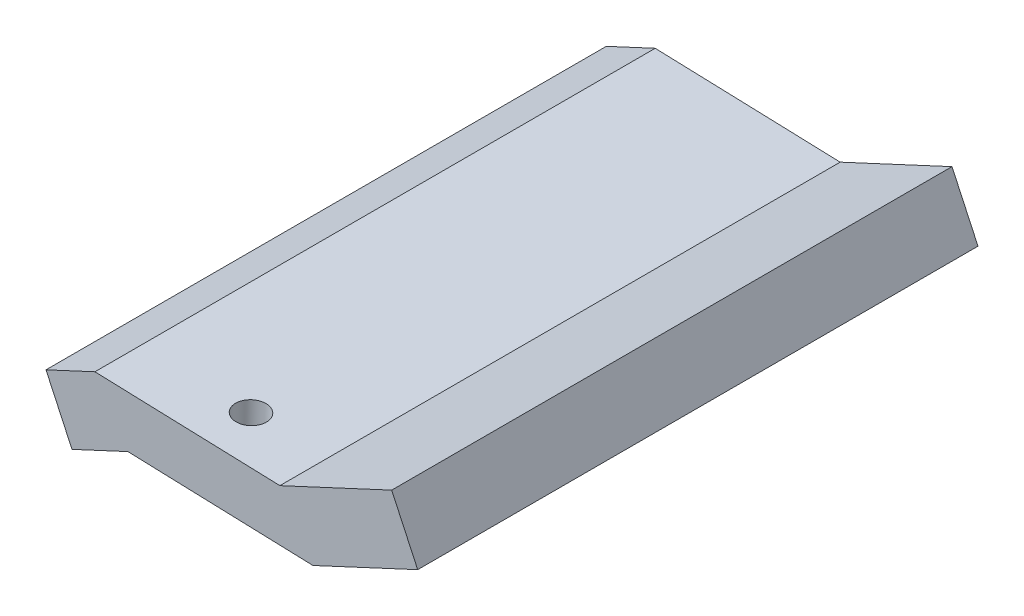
ISO-10303-21;
HEADER;
FILE_DESCRIPTION(('STEP AP214'),'2;1');
FILE_NAME('part.step','',(''),(''),'','','');
FILE_SCHEMA(('AUTOMOTIVE_DESIGN { 1 0 10303 214 1 1 1 1 }'));
ENDSEC;
DATA;
#1=APPLICATION_CONTEXT('core data for automotive mechanical design processes');
#2=APPLICATION_PROTOCOL_DEFINITION('international standard','automotive_design',2000,#1);
#3=PRODUCT_CONTEXT('',#1,'mechanical');
#4=PRODUCT('Part','Part','',(#3));
#5=PRODUCT_RELATED_PRODUCT_CATEGORY('part','',(#4));
#6=PRODUCT_DEFINITION_FORMATION('','',#4);
#7=PRODUCT_DEFINITION_CONTEXT('part definition',#1,'design');
#8=PRODUCT_DEFINITION('design','',#6,#7);
#9=PRODUCT_DEFINITION_SHAPE('','',#8);
#10=(LENGTH_UNIT() NAMED_UNIT(*) SI_UNIT(.MILLI.,.METRE.));
#11=(NAMED_UNIT(*) PLANE_ANGLE_UNIT() SI_UNIT($,.RADIAN.));
#12=(NAMED_UNIT(*) SI_UNIT($,.STERADIAN.) SOLID_ANGLE_UNIT());
#13=UNCERTAINTY_MEASURE_WITH_UNIT(LENGTH_MEASURE(1.E-05),#10,'distance_accuracy_value','');
#14=(GEOMETRIC_REPRESENTATION_CONTEXT(3) GLOBAL_UNCERTAINTY_ASSIGNED_CONTEXT((#13)) GLOBAL_UNIT_ASSIGNED_CONTEXT((#10,
#11,#12)) REPRESENTATION_CONTEXT('',''));
#15=CARTESIAN_POINT('',(0.,0.,0.));
#16=DIRECTION('',(0.,0.,1.));
#17=DIRECTION('',(1.,0.,0.));
#18=AXIS2_PLACEMENT_3D('',#15,#16,#17);
#19=CARTESIAN_POINT('',(-26.3217395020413,-14.1285833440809,0.));
#20=DIRECTION('',(0.421835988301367,-0.906672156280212,0.));
#21=DIRECTION('',(0.906672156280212,0.421835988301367,0.));
#22=AXIS2_PLACEMENT_3D('',#19,#20,#21);
#23=PLANE('',#22);
#24=DIRECTION('',(0.906672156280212,0.421835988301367,0.));
#25=VECTOR('',#24,1.);
#26=CARTESIAN_POINT('',(-33.575116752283,-17.5032712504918,0.));
#27=LINE('',#26,#25);
#28=CARTESIAN_POINT('',(-33.575116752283,-17.5032712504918,0.));
#29=VERTEX_POINT('',#28);
#30=CARTESIAN_POINT('',(-26.3217395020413,-14.1285833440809,0.));
#31=VERTEX_POINT('',#30);
#32=EDGE_CURVE('E135',#29,#31,#27,.T.);
#33=ORIENTED_EDGE('',*,*,#32,.T.);
#34=DIRECTION('',(0.,0.,1.));
#35=VECTOR('',#34,1.);
#36=CARTESIAN_POINT('',(-26.3217395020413,-14.1285833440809,0.));
#37=LINE('',#36,#35);
#38=CARTESIAN_POINT('',(-26.3217395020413,-14.1285833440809,72.7));
#39=VERTEX_POINT('',#38);
#40=EDGE_CURVE('E78',#39,#31,#37,.F.);
#41=ORIENTED_EDGE('',*,*,#40,.F.);
#42=DIRECTION('',(0.906672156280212,0.421835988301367,0.));
#43=VECTOR('',#42,1.);
#44=CARTESIAN_POINT('',(-33.575116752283,-17.5032712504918,72.7));
#45=LINE('',#44,#43);
#46=CARTESIAN_POINT('',(-33.575116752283,-17.5032712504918,72.7));
#47=VERTEX_POINT('',#46);
#48=EDGE_CURVE('E94',#47,#39,#45,.T.);
#49=ORIENTED_EDGE('',*,*,#48,.F.);
#50=DIRECTION('',(0.,0.,1.));
#51=VECTOR('',#50,1.);
#52=CARTESIAN_POINT('',(-33.575116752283,-17.5032712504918,0.));
#53=LINE('',#52,#51);
#54=EDGE_CURVE('E83',#29,#47,#53,.T.);
#55=ORIENTED_EDGE('',*,*,#54,.F.);
#56=EDGE_LOOP('',(#33,#41,#49,#55));
#57=FACE_BOUND('',#56,.T.);
#58=ADVANCED_FACE('F17',(#57),#23,.T.);
#59=CARTESIAN_POINT('',(11.2783428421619,-8.59632905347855,0.));
#60=DIRECTION('',(0.421835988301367,-0.906672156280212,0.));
#61=DIRECTION('',(0.906672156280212,0.421835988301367,0.));
#62=AXIS2_PLACEMENT_3D('',#59,#60,#61);
#63=PLANE('',#62);
#64=DIRECTION('',(0.906672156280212,0.421835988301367,0.));
#65=VECTOR('',#64,1.);
#66=CARTESIAN_POINT('',(-2.32173950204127,-14.923868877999,0.));
#67=LINE('',#66,#65);
#68=CARTESIAN_POINT('',(-2.32173950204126,-14.923868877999,0.));
#69=VERTEX_POINT('',#68);
#70=CARTESIAN_POINT('',(11.2783428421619,-8.59632905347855,0.));
#71=VERTEX_POINT('',#70);
#72=EDGE_CURVE('E125',#69,#71,#67,.T.);
#73=ORIENTED_EDGE('',*,*,#72,.T.);
#74=DIRECTION('',(0.,0.,1.));
#75=VECTOR('',#74,1.);
#76=CARTESIAN_POINT('',(11.2783428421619,-8.59632905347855,0.));
#77=LINE('',#76,#75);
#78=CARTESIAN_POINT('',(11.2783428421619,-8.59632905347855,72.7));
#79=VERTEX_POINT('',#78);
#80=EDGE_CURVE('E91',#79,#71,#77,.F.);
#81=ORIENTED_EDGE('',*,*,#80,.F.);
#82=DIRECTION('',(0.906672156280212,0.421835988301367,0.));
#83=VECTOR('',#82,1.);
#84=CARTESIAN_POINT('',(-2.32173950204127,-14.923868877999,72.7));
#85=LINE('',#84,#83);
#86=CARTESIAN_POINT('',(-2.32173950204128,-14.9238688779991,72.7));
#87=VERTEX_POINT('',#86);
#88=EDGE_CURVE('E143',#87,#79,#85,.T.);
#89=ORIENTED_EDGE('',*,*,#88,.F.);
#90=DIRECTION('',(0.,0.,1.));
#91=VECTOR('',#90,1.);
#92=CARTESIAN_POINT('',(-2.32173950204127,-14.923868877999,0.));
#93=LINE('',#92,#91);
#94=EDGE_CURVE('E103',#69,#87,#93,.T.);
#95=ORIENTED_EDGE('',*,*,#94,.F.);
#96=EDGE_LOOP('',(#73,#81,#89,#95));
#97=FACE_BOUND('',#96,.T.);
#98=ADVANCED_FACE('F146',(#97),#63,.T.);
#99=CARTESIAN_POINT('',(7.90365493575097,-1.34295180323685,0.));
#100=DIRECTION('',(0.906672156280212,0.421835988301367,0.));
#101=DIRECTION('',(-0.421835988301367,0.906672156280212,0.));
#102=AXIS2_PLACEMENT_3D('',#99,#100,#101);
#103=PLANE('',#102);
#104=DIRECTION('',(-0.421835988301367,0.906672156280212,0.));
#105=VECTOR('',#104,1.);
#106=CARTESIAN_POINT('',(11.2783428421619,-8.59632905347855,0.));
#107=LINE('',#106,#105);
#108=CARTESIAN_POINT('',(7.90365493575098,-1.34295180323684,0.));
#109=VERTEX_POINT('',#108);
#110=EDGE_CURVE('E115',#71,#109,#107,.T.);
#111=ORIENTED_EDGE('',*,*,#110,.T.);
#112=DIRECTION('',(0.,0.,1.));
#113=VECTOR('',#112,1.);
#114=CARTESIAN_POINT('',(7.90365493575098,-1.34295180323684,0.));
#115=LINE('',#114,#113);
#116=CARTESIAN_POINT('',(7.90365493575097,-1.34295180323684,72.7));
#117=VERTEX_POINT('',#116);
#118=EDGE_CURVE('E137',#117,#109,#115,.F.);
#119=ORIENTED_EDGE('',*,*,#118,.F.);
#120=DIRECTION('',(-0.421835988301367,0.906672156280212,0.));
#121=VECTOR('',#120,1.);
#122=CARTESIAN_POINT('',(11.2783428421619,-8.59632905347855,72.7));
#123=LINE('',#122,#121);
#124=EDGE_CURVE('E117',#79,#117,#123,.T.);
#125=ORIENTED_EDGE('',*,*,#124,.F.);
#126=ORIENTED_EDGE('',*,*,#80,.T.);
#127=EDGE_LOOP('',(#111,#119,#125,#126));
#128=FACE_BOUND('',#127,.T.);
#129=ADVANCED_FACE('F113',(#128),#103,.T.);
#130=CARTESIAN_POINT('',(-33.575116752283,-17.5032712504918,0.));
#131=DIRECTION('',(-0.906672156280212,-0.421835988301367,0.));
#132=DIRECTION('',(0.421835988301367,-0.906672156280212,0.));
#133=AXIS2_PLACEMENT_3D('',#130,#131,#132);
#134=PLANE('',#133);
#135=DIRECTION('',(0.421835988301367,-0.906672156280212,0.));
#136=VECTOR('',#135,1.);
#137=CARTESIAN_POINT('',(-36.9498046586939,-10.2498940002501,0.));
#138=LINE('',#137,#136);
#139=CARTESIAN_POINT('',(-36.9498046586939,-10.2498940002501,0.));
#140=VERTEX_POINT('',#139);
#141=EDGE_CURVE('E89',#140,#29,#138,.T.);
#142=ORIENTED_EDGE('',*,*,#141,.T.);
#143=ORIENTED_EDGE('',*,*,#54,.T.);
#144=DIRECTION('',(0.421835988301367,-0.906672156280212,0.));
#145=VECTOR('',#144,1.);
#146=CARTESIAN_POINT('',(-36.9498046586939,-10.2498940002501,72.7));
#147=LINE('',#146,#145);
#148=CARTESIAN_POINT('',(-36.9498046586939,-10.2498940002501,72.7));
#149=VERTEX_POINT('',#148);
#150=EDGE_CURVE('E87',#149,#47,#147,.T.);
#151=ORIENTED_EDGE('',*,*,#150,.F.);
#152=DIRECTION('',(0.,0.,1.));
#153=VECTOR('',#152,1.);
#154=CARTESIAN_POINT('',(-36.9498046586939,-10.2498940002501,0.));
#155=LINE('',#154,#153);
#156=EDGE_CURVE('E230',#140,#149,#155,.T.);
#157=ORIENTED_EDGE('',*,*,#156,.F.);
#158=EDGE_LOOP('',(#142,#143,#151,#157));
#159=FACE_BOUND('',#158,.T.);
#160=ADVANCED_FACE('F84',(#159),#134,.T.);
#161=CARTESIAN_POINT('',(-2.32173950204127,-14.923868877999,0.));
#162=DIRECTION('',(-0.033118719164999,-0.999451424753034,0.));
#163=DIRECTION('',(0.999451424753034,-0.033118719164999,0.));
#164=AXIS2_PLACEMENT_3D('',#161,#162,#163);
#165=PLANE('',#164);
#166=CARTESIAN_POINT('',(-16.5731354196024,-14.4516218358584,66.7));
#167=DIRECTION('',(0.033118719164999,0.999451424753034,0.));
#168=DIRECTION('',(-0.999451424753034,0.033118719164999,0.));
#169=AXIS2_PLACEMENT_3D('',#166,#167,#168);
#170=CIRCLE('',#169,2.);
#171=CARTESIAN_POINT('',(-18.5720382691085,-14.3853843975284,66.7));
#172=VERTEX_POINT('',#171);
#173=EDGE_CURVE('E20',#172,#172,#170,.T.);
#174=ORIENTED_EDGE('',*,*,#173,.T.);
#175=EDGE_LOOP('',(#174));
#176=FACE_BOUND('',#175,.T.);
#177=DIRECTION('',(0.999451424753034,-0.0331187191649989,0.));
#178=VECTOR('',#177,1.);
#179=CARTESIAN_POINT('',(-26.3217395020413,-14.1285833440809,0.));
#180=LINE('',#179,#178);
#181=EDGE_CURVE('E129',#31,#69,#180,.T.);
#182=ORIENTED_EDGE('',*,*,#181,.T.);
#183=ORIENTED_EDGE('',*,*,#94,.T.);
#184=DIRECTION('',(0.999451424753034,-0.0331187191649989,0.));
#185=VECTOR('',#184,1.);
#186=CARTESIAN_POINT('',(-26.3217395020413,-14.1285833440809,72.7));
#187=LINE('',#186,#185);
#188=EDGE_CURVE('E97',#39,#87,#187,.T.);
#189=ORIENTED_EDGE('',*,*,#188,.F.);
#190=ORIENTED_EDGE('',*,*,#40,.T.);
#191=EDGE_LOOP('',(#182,#183,#189,#190));
#192=FACE_BOUND('',#191,.T.);
#193=ADVANCED_FACE('F145',(#176,#192),#165,.T.);
#194=CARTESIAN_POINT('',(-12.6737388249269,-10.2174598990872,72.7));
#195=DIRECTION('',(0.,0.,1.));
#196=DIRECTION('',(1.,0.,0.));
#197=AXIS2_PLACEMENT_3D('',#194,#195,#196);
#198=PLANE('',#197);
#199=DIRECTION('',(-0.906672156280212,-0.421835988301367,0.));
#200=VECTOR('',#199,1.);
#201=CARTESIAN_POINT('',(-6.60309956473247,-8.09232761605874,72.7));
#202=LINE('',#201,#200);
#203=CARTESIAN_POINT('',(-6.60309956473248,-8.09232761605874,72.7));
#204=VERTEX_POINT('',#203);
#205=EDGE_CURVE('E139',#204,#117,#202,.F.);
#206=ORIENTED_EDGE('',*,*,#205,.F.);
#207=DIRECTION('',(-0.999451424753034,0.033118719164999,0.));
#208=VECTOR('',#207,1.);
#209=CARTESIAN_POINT('',(-30.6030995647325,-7.29704208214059,72.7));
#210=LINE('',#209,#208);
#211=CARTESIAN_POINT('',(-30.6030995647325,-7.29704208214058,72.7));
#212=VERTEX_POINT('',#211);
#213=EDGE_CURVE('E229',#212,#204,#210,.F.);
#214=ORIENTED_EDGE('',*,*,#213,.F.);
#215=DIRECTION('',(-0.906672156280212,-0.421835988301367,0.));
#216=VECTOR('',#215,1.);
#217=CARTESIAN_POINT('',(-36.9498046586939,-10.2498940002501,72.7));
#218=LINE('',#217,#216);
#219=EDGE_CURVE('E101',#149,#212,#218,.F.);
#220=ORIENTED_EDGE('',*,*,#219,.F.);
#221=ORIENTED_EDGE('',*,*,#150,.T.);
#222=ORIENTED_EDGE('',*,*,#48,.T.);
#223=ORIENTED_EDGE('',*,*,#188,.T.);
#224=ORIENTED_EDGE('',*,*,#88,.T.);
#225=ORIENTED_EDGE('',*,*,#124,.T.);
#226=EDGE_LOOP('',(#206,#214,#220,#221,#222,#223,#224,#225));
#227=FACE_BOUND('',#226,.T.);
#228=ADVANCED_FACE('F99',(#227),#198,.T.);
#229=CARTESIAN_POINT('',(-6.60309956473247,-8.09232761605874,0.));
#230=DIRECTION('',(-0.421835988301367,0.906672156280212,0.));
#231=DIRECTION('',(-0.906672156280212,-0.421835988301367,0.));
#232=AXIS2_PLACEMENT_3D('',#229,#230,#231);
#233=PLANE('',#232);
#234=DIRECTION('',(-0.906672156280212,-0.421835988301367,0.));
#235=VECTOR('',#234,1.);
#236=CARTESIAN_POINT('',(7.90365493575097,-1.34295180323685,0.));
#237=LINE('',#236,#235);
#238=CARTESIAN_POINT('',(-6.60309956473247,-8.09232761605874,0.));
#239=VERTEX_POINT('',#238);
#240=EDGE_CURVE('E126',#109,#239,#237,.T.);
#241=ORIENTED_EDGE('',*,*,#240,.T.);
#242=DIRECTION('',(0.,0.,1.));
#243=VECTOR('',#242,1.);
#244=CARTESIAN_POINT('',(-6.60309956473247,-8.09232761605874,0.));
#245=LINE('',#244,#243);
#246=EDGE_CURVE('E232',#204,#239,#245,.F.);
#247=ORIENTED_EDGE('',*,*,#246,.F.);
#248=ORIENTED_EDGE('',*,*,#205,.T.);
#249=ORIENTED_EDGE('',*,*,#118,.T.);
#250=EDGE_LOOP('',(#241,#247,#248,#249));
#251=FACE_BOUND('',#250,.T.);
#252=ADVANCED_FACE('F172',(#251),#233,.T.);
#253=CARTESIAN_POINT('',(-12.6737388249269,-10.2174598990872,0.));
#254=DIRECTION('',(0.,0.,1.));
#255=DIRECTION('',(1.,0.,0.));
#256=AXIS2_PLACEMENT_3D('',#253,#254,#255);
#257=PLANE('',#256);
#258=DIRECTION('',(-0.906672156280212,-0.421835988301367,0.));
#259=VECTOR('',#258,1.);
#260=CARTESIAN_POINT('',(-36.9498046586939,-10.2498940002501,0.));
#261=LINE('',#260,#259);
#262=CARTESIAN_POINT('',(-30.6030995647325,-7.29704208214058,0.));
#263=VERTEX_POINT('',#262);
#264=EDGE_CURVE('E34',#263,#140,#261,.T.);
#265=ORIENTED_EDGE('',*,*,#264,.F.);
#266=DIRECTION('',(-0.999451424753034,0.033118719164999,0.));
#267=VECTOR('',#266,1.);
#268=CARTESIAN_POINT('',(-30.6030995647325,-7.29704208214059,0.));
#269=LINE('',#268,#267);
#270=EDGE_CURVE('E241',#239,#263,#269,.T.);
#271=ORIENTED_EDGE('',*,*,#270,.F.);
#272=ORIENTED_EDGE('',*,*,#240,.F.);
#273=ORIENTED_EDGE('',*,*,#110,.F.);
#274=ORIENTED_EDGE('',*,*,#72,.F.);
#275=ORIENTED_EDGE('',*,*,#181,.F.);
#276=ORIENTED_EDGE('',*,*,#32,.F.);
#277=ORIENTED_EDGE('',*,*,#141,.F.);
#278=EDGE_LOOP('',(#265,#271,#272,#273,#274,#275,#276,#277));
#279=FACE_BOUND('',#278,.T.);
#280=ADVANCED_FACE('F123',(#279),#257,.F.);
#281=CARTESIAN_POINT('',(-36.9498046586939,-10.2498940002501,0.));
#282=DIRECTION('',(-0.421835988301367,0.906672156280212,0.));
#283=DIRECTION('',(-0.906672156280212,-0.421835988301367,0.));
#284=AXIS2_PLACEMENT_3D('',#281,#282,#283);
#285=PLANE('',#284);
#286=ORIENTED_EDGE('',*,*,#264,.T.);
#287=ORIENTED_EDGE('',*,*,#156,.T.);
#288=ORIENTED_EDGE('',*,*,#219,.T.);
#289=DIRECTION('',(0.,0.,1.));
#290=VECTOR('',#289,1.);
#291=CARTESIAN_POINT('',(-30.6030995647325,-7.29704208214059,0.));
#292=LINE('',#291,#290);
#293=EDGE_CURVE('E26',#263,#212,#292,.T.);
#294=ORIENTED_EDGE('',*,*,#293,.F.);
#295=EDGE_LOOP('',(#286,#287,#288,#294));
#296=FACE_BOUND('',#295,.T.);
#297=ADVANCED_FACE('F162',(#296),#285,.T.);
#298=CARTESIAN_POINT('',(-16.5731354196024,-14.4516218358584,66.7));
#299=DIRECTION('',(0.033118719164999,0.999451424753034,0.));
#300=DIRECTION('',(-0.999451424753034,0.033118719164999,0.));
#301=AXIS2_PLACEMENT_3D('',#298,#299,#300);
#302=CYLINDRICAL_SURFACE('',#301,2.);
#303=ORIENTED_EDGE('',*,*,#173,.F.);
#304=EDGE_LOOP('',(#303));
#305=FACE_BOUND('',#304,.T.);
#306=CARTESIAN_POINT('',(-16.3517036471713,-7.76928912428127,66.7));
#307=DIRECTION('',(0.033118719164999,0.999451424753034,0.));
#308=DIRECTION('',(-0.999451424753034,0.033118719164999,0.));
#309=AXIS2_PLACEMENT_3D('',#306,#307,#308);
#310=CIRCLE('',#309,2.);
#311=CARTESIAN_POINT('',(-18.3506064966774,-7.70305168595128,66.7));
#312=VERTEX_POINT('',#311);
#313=EDGE_CURVE('E11',#312,#312,#310,.F.);
#314=ORIENTED_EDGE('',*,*,#313,.F.);
#315=EDGE_LOOP('',(#314));
#316=FACE_BOUND('',#315,.T.);
#317=ADVANCED_FACE('F156',(#305,#316),#302,.F.);
#318=CARTESIAN_POINT('',(-30.6030995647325,-7.29704208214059,0.));
#319=DIRECTION('',(0.033118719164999,0.999451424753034,0.));
#320=DIRECTION('',(-0.999451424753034,0.033118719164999,0.));
#321=AXIS2_PLACEMENT_3D('',#318,#319,#320);
#322=PLANE('',#321);
#323=ORIENTED_EDGE('',*,*,#313,.T.);
#324=EDGE_LOOP('',(#323));
#325=FACE_BOUND('',#324,.T.);
#326=ORIENTED_EDGE('',*,*,#270,.T.);
#327=ORIENTED_EDGE('',*,*,#293,.T.);
#328=ORIENTED_EDGE('',*,*,#213,.T.);
#329=ORIENTED_EDGE('',*,*,#246,.T.);
#330=EDGE_LOOP('',(#326,#327,#328,#329));
#331=FACE_BOUND('',#330,.T.);
#332=ADVANCED_FACE('F154',(#325,#331),#322,.T.);
#333=CLOSED_SHELL('',(#58,#98,#129,#160,#193,#228,#252,#280,#297,#317,#332));
#334=MANIFOLD_SOLID_BREP('B1',#333);
#335=ADVANCED_BREP_SHAPE_REPRESENTATION('',(#18,#334),#14);
#336=SHAPE_DEFINITION_REPRESENTATION(#9,#335);
ENDSEC;
END-ISO-10303-21;
